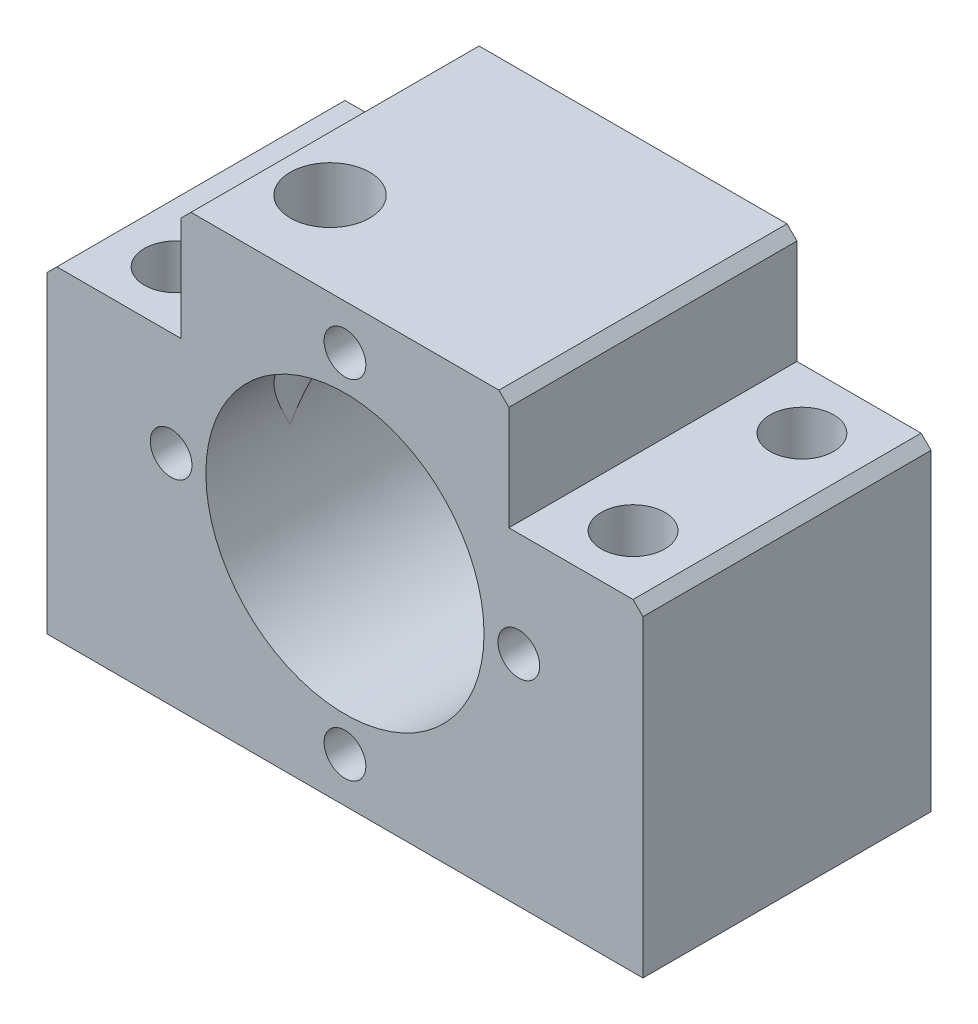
from build123d import *

# Parameters (mm, degrees)
ESQUISSE1_R                                        = 12.5
BOSS_EXTRU_1_DEPTH                                 = 29
CHAMBRAGE_POUR_VIS_T_TE_HEXAGONALE_M61_D           = 6.4
CHAMBRAGE_POUR_VIS_T_TE_HEXAGONALE_M61_CBORE_D     = 11
CHAMBRAGE_POUR_VIS_T_TE_HEXAGONALE_M61_CBORE_DEPTH = 6.4
ENL_V_START                                        = -3
ESQUISSE7_R                                        = 14
ENL_V_MAT_EXTRU_2_DEPTH                            = 45.16990566
CHANFREIN2_SIZE                                    = 1
DIAM_TRE_DU_PER_AGE_4_2_4_2_1_D                    = 4.2
DIAM_TRE_DU_PER_AGE_8_0_8_1_D                      = 8
DIAM_TRE_DU_PER_AGE_8_0_8_1_DEPTH                  = 22
DIAM_TRE_DU_PER_AGE_8_0_8_1_TIP                    = 2.403442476
CHANFREIN3_SIZE                                    = 1


with BuildPart() as part:
    # Esquisse1 → Boss.-Extru.1 (new body)
    with BuildSketch(Plane.XY):
        Polygon((-16.5, 22), (16.5, 22), (16.5, 10.5), (30, 10.5), (30, -22), (-30, -22), (-30, 10.5), (-16.5, 10.5), align=None)
        with Locations(Location((0, 0, 0), (0, 0, 180))):
            Circle(ESQUISSE1_R, mode=Mode.SUBTRACT)
    extrude(amount=BOSS_EXTRU_1_DEPTH)

    # Chambrage pour vis _ t_te hexagonale M61 (through all)
    with Locations(Plane(origin=(0, 22, 0), x_dir=(1, 0, 0), z_dir=(0, 1, 0))):
        with Locations((-23, -6), (-23, -23), (23, -23), (23, -6)):
            CounterBoreHole(CHAMBRAGE_POUR_VIS_T_TE_HEXAGONALE_M61_D / 2, CHAMBRAGE_POUR_VIS_T_TE_HEXAGONALE_M61_CBORE_D / 2, CHAMBRAGE_POUR_VIS_T_TE_HEXAGONALE_M61_CBORE_DEPTH)

    # Esquisse7 → Enl_v. mat.-Extru.2 (cut, through all)
    with BuildSketch(Plane(origin=(0, 0, 0), x_dir=(-1, 0, 0), z_dir=(0, 0, -1)).offset(ENL_V_START)):
        Circle(ESQUISSE7_R)
    extrude(amount=-ENL_V_MAT_EXTRU_2_DEPTH, mode=Mode.SUBTRACT)

    # Chanfrein2
    chanfrein2_edges = [part.edges().sort_by_distance(p)[0] for p in [
        (-30, 10.5, 14.5),
        (-16.5, 22, 14.5),
        (16.5, 22, 14.5),
        (30, 10.5, 14.5),
    ]]
    chamfer(chanfrein2_edges, length=CHANFREIN2_SIZE)

    # Diam_tre du per_age _4.2 _4.2_1 (through all)
    with Locations(Plane(origin=(0, 0, 0), x_dir=(1, 0, 0), z_dir=(0, 0, -1))):
        with Locations((0, -17.5), (-17.5, 0), (17.5, 0), (0, 17.5)):
            Hole(DIAM_TRE_DU_PER_AGE_4_2_4_2_1_D / 2)

    # Diam_tre du per_age _8.0 _8_1
    with Locations(Plane(origin=(0, 22, 0), x_dir=(1, 0, 0), z_dir=(0, 1, 0))):
        with Locations((-10, -20.5)):
            Hole(DIAM_TRE_DU_PER_AGE_8_0_8_1_D / 2, depth=DIAM_TRE_DU_PER_AGE_8_0_8_1_DEPTH)
            with Locations((0, 0, -(DIAM_TRE_DU_PER_AGE_8_0_8_1_DEPTH + DIAM_TRE_DU_PER_AGE_8_0_8_1_TIP / 2))):  # 118° drill point
                Cone(0, DIAM_TRE_DU_PER_AGE_8_0_8_1_D / 2, DIAM_TRE_DU_PER_AGE_8_0_8_1_TIP, mode=Mode.SUBTRACT)

    # Chanfrein3
    chanfrein3_edges = [part.edges().sort_by_distance(p)[0] for p in [
        (12.5, 0, 0),
    ]]
    chamfer(chanfrein3_edges, length=CHANFREIN3_SIZE)


solid = part.part
